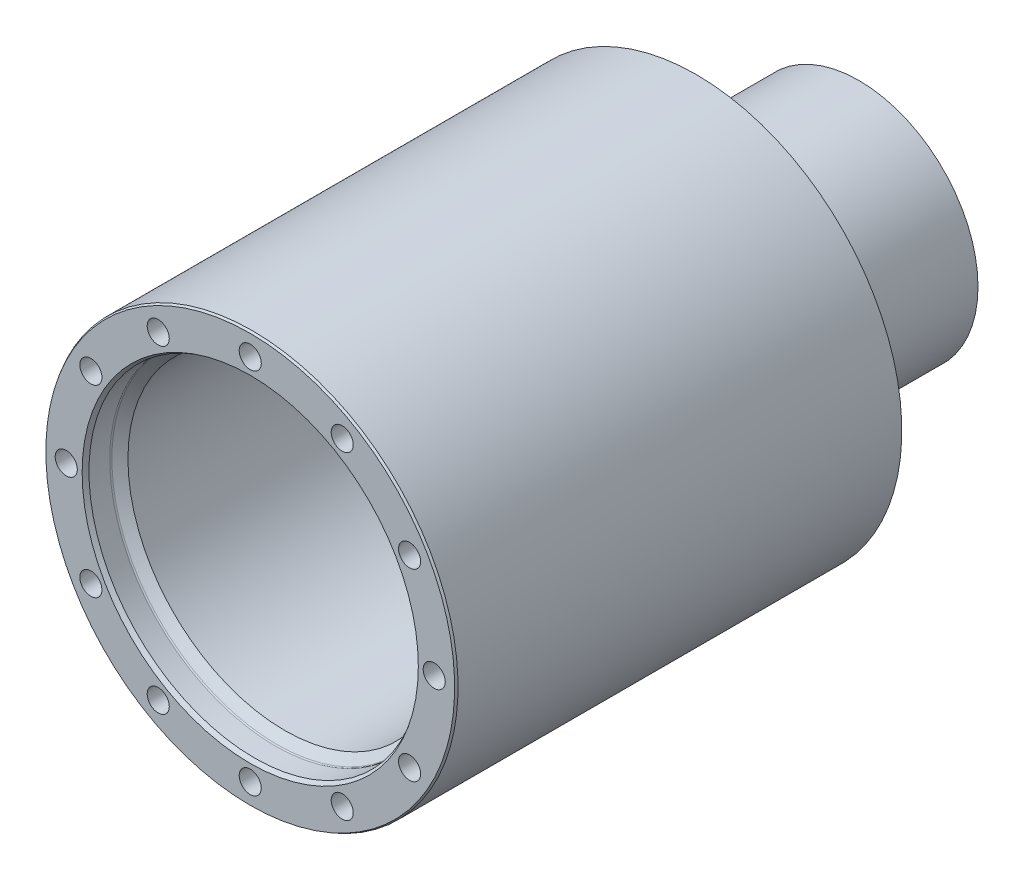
ISO-10303-21;
HEADER;
FILE_DESCRIPTION(('STEP AP214'),'2;1');
FILE_NAME('part.step','',(''),(''),'','','');
FILE_SCHEMA(('AUTOMOTIVE_DESIGN { 1 0 10303 214 1 1 1 1 }'));
ENDSEC;
DATA;
#1=APPLICATION_CONTEXT('core data for automotive mechanical design processes');
#2=APPLICATION_PROTOCOL_DEFINITION('international standard','automotive_design',2000,#1);
#3=PRODUCT_CONTEXT('',#1,'mechanical');
#4=PRODUCT('Part','Part','',(#3));
#5=PRODUCT_RELATED_PRODUCT_CATEGORY('part','',(#4));
#6=PRODUCT_DEFINITION_FORMATION('','',#4);
#7=PRODUCT_DEFINITION_CONTEXT('part definition',#1,'design');
#8=PRODUCT_DEFINITION('design','',#6,#7);
#9=PRODUCT_DEFINITION_SHAPE('','',#8);
#10=(LENGTH_UNIT() NAMED_UNIT(*) SI_UNIT(.MILLI.,.METRE.));
#11=(NAMED_UNIT(*) PLANE_ANGLE_UNIT() SI_UNIT($,.RADIAN.));
#12=(NAMED_UNIT(*) SI_UNIT($,.STERADIAN.) SOLID_ANGLE_UNIT());
#13=UNCERTAINTY_MEASURE_WITH_UNIT(LENGTH_MEASURE(1.E-05),#10,'distance_accuracy_value','');
#14=(GEOMETRIC_REPRESENTATION_CONTEXT(3) GLOBAL_UNCERTAINTY_ASSIGNED_CONTEXT((#13)) GLOBAL_UNIT_ASSIGNED_CONTEXT((#10,
#11,#12)) REPRESENTATION_CONTEXT('',''));
#15=CARTESIAN_POINT('',(0.,0.,0.));
#16=DIRECTION('',(0.,0.,1.));
#17=DIRECTION('',(1.,0.,0.));
#18=AXIS2_PLACEMENT_3D('',#15,#16,#17);
#19=CARTESIAN_POINT('',(0.,7.15584993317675E-07,41.));
#20=DIRECTION('',(0.,-1.74532925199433E-08,-1.));
#21=DIRECTION('',(0.,-1.,1.74532925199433E-08));
#22=AXIS2_PLACEMENT_3D('',#19,#20,#21);
#23=PLANE('',#22);
#24=CARTESIAN_POINT('',(7.354117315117E-13,7.15585575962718E-07,41.));
#25=DIRECTION('',(0.,1.74532925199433E-08,1.));
#26=DIRECTION('',(0.,-1.,1.74532925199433E-08));
#27=AXIS2_PLACEMENT_3D('',#24,#25,#26);
#28=CIRCLE('',#27,94.4226445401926);
#29=CARTESIAN_POINT('',(0.,-94.422643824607,41.0000016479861));
#30=VERTEX_POINT('',#29);
#31=EDGE_CURVE('E11',#30,#30,#28,.T.);
#32=ORIENTED_EDGE('',*,*,#31,.T.);
#33=EDGE_LOOP('',(#32));
#34=FACE_BOUND('',#33,.T.);
#35=CARTESIAN_POINT('',(0.,85.000000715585,40.9999985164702));
#36=DIRECTION('',(0.,1.74532925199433E-08,1.));
#37=DIRECTION('',(0.,1.,-1.74532925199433E-08));
#38=AXIS2_PLACEMENT_3D('',#35,#36,#37);
#39=CIRCLE('',#38,5.1);
#40=CARTESIAN_POINT('',(0.,90.100000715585,40.9999984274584));
#41=VERTEX_POINT('',#40);
#42=EDGE_CURVE('E248',#41,#41,#39,.T.);
#43=ORIENTED_EDGE('',*,*,#42,.F.);
#44=EDGE_LOOP('',(#43));
#45=FACE_BOUND('',#44,.T.);
#46=CARTESIAN_POINT('',(42.5,73.612160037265,40.9999987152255));
#47=DIRECTION('',(0.,1.74532925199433E-08,1.));
#48=DIRECTION('',(0.500000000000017,0.866025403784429,-1.51149947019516E-08));
#49=AXIS2_PLACEMENT_3D('',#46,#47,#48);
#50=CIRCLE('',#49,5.1);
#51=CARTESIAN_POINT('',(45.05,78.028889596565,40.999998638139));
#52=VERTEX_POINT('',#51);
#53=EDGE_CURVE('E249',#52,#52,#50,.T.);
#54=ORIENTED_EDGE('',*,*,#53,.F.);
#55=EDGE_LOOP('',(#54));
#56=FACE_BOUND('',#55,.T.);
#57=CARTESIAN_POINT('',(73.61215932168,42.500000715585,40.9999992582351));
#58=DIRECTION('',(0.,1.74532925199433E-08,1.));
#59=DIRECTION('',(0.866025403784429,0.500000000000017,-8.72664625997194E-09));
#60=AXIS2_PLACEMENT_3D('',#57,#58,#59);
#61=CIRCLE('',#60,5.1);
#62=CARTESIAN_POINT('',(78.02888888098,45.050000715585,40.9999992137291));
#63=VERTEX_POINT('',#62);
#64=EDGE_CURVE('E259',#63,#63,#61,.T.);
#65=ORIENTED_EDGE('',*,*,#64,.F.);
#66=EDGE_LOOP('',(#65));
#67=FACE_BOUND('',#66,.T.);
#68=CARTESIAN_POINT('',(85.,7.15584993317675E-07,41.));
#69=DIRECTION('',(0.,1.74532925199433E-08,1.));
#70=DIRECTION('',(1.,0.,0.));
#71=AXIS2_PLACEMENT_3D('',#68,#69,#70);
#72=CIRCLE('',#71,5.1);
#73=CARTESIAN_POINT('',(90.1,7.15584993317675E-07,41.));
#74=VERTEX_POINT('',#73);
#75=EDGE_CURVE('E230',#74,#74,#72,.T.);
#76=ORIENTED_EDGE('',*,*,#75,.F.);
#77=EDGE_LOOP('',(#76));
#78=FACE_BOUND('',#77,.T.);
#79=CARTESIAN_POINT('',(73.61215932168,-42.499999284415,41.0000007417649));
#80=DIRECTION('',(0.,1.74532925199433E-08,1.));
#81=DIRECTION('',(0.866025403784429,-0.500000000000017,8.72664625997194E-09));
#82=AXIS2_PLACEMENT_3D('',#79,#80,#81);
#83=CIRCLE('',#82,5.1);
#84=CARTESIAN_POINT('',(78.02888888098,-45.049999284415,41.0000007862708));
#85=VERTEX_POINT('',#84);
#86=EDGE_CURVE('E231',#85,#85,#83,.T.);
#87=ORIENTED_EDGE('',*,*,#86,.F.);
#88=EDGE_LOOP('',(#87));
#89=FACE_BOUND('',#88,.T.);
#90=CARTESIAN_POINT('',(42.5,-73.612158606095,41.0000012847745));
#91=DIRECTION('',(0.,1.74532925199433E-08,1.));
#92=DIRECTION('',(0.500000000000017,-0.866025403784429,1.51149947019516E-08));
#93=AXIS2_PLACEMENT_3D('',#90,#91,#92);
#94=CIRCLE('',#93,5.1);
#95=CARTESIAN_POINT('',(45.05,-78.028888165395,41.000001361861));
#96=VERTEX_POINT('',#95);
#97=EDGE_CURVE('E236',#96,#96,#94,.T.);
#98=ORIENTED_EDGE('',*,*,#97,.F.);
#99=EDGE_LOOP('',(#98));
#100=FACE_BOUND('',#99,.T.);
#101=CARTESIAN_POINT('',(0.,-84.999999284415,41.0000014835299));
#102=DIRECTION('',(0.,1.74532925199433E-08,1.));
#103=DIRECTION('',(0.,-1.,1.74532925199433E-08));
#104=AXIS2_PLACEMENT_3D('',#101,#102,#103);
#105=CIRCLE('',#104,5.1);
#106=CARTESIAN_POINT('',(0.,-90.099999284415,41.0000015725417));
#107=VERTEX_POINT('',#106);
#108=EDGE_CURVE('E281',#107,#107,#105,.T.);
#109=ORIENTED_EDGE('',*,*,#108,.F.);
#110=EDGE_LOOP('',(#109));
#111=FACE_BOUND('',#110,.T.);
#112=CARTESIAN_POINT('',(-42.5,-73.612158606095,41.0000012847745));
#113=DIRECTION('',(0.,1.74532925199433E-08,1.));
#114=DIRECTION('',(-0.500000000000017,-0.866025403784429,1.51149947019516E-08));
#115=AXIS2_PLACEMENT_3D('',#112,#113,#114);
#116=CIRCLE('',#115,5.1);
#117=CARTESIAN_POINT('',(-45.05,-78.028888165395,41.000001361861));
#118=VERTEX_POINT('',#117);
#119=EDGE_CURVE('E282',#118,#118,#116,.T.);
#120=ORIENTED_EDGE('',*,*,#119,.F.);
#121=EDGE_LOOP('',(#120));
#122=FACE_BOUND('',#121,.T.);
#123=CARTESIAN_POINT('',(-73.61215932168,-42.499999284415,41.0000007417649));
#124=DIRECTION('',(0.,1.74532925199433E-08,1.));
#125=DIRECTION('',(-0.866025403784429,-0.500000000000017,8.72664625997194E-09));
#126=AXIS2_PLACEMENT_3D('',#123,#124,#125);
#127=CIRCLE('',#126,5.1);
#128=CARTESIAN_POINT('',(-78.02888888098,-45.049999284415,41.0000007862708));
#129=VERTEX_POINT('',#128);
#130=EDGE_CURVE('E272',#129,#129,#127,.T.);
#131=ORIENTED_EDGE('',*,*,#130,.F.);
#132=EDGE_LOOP('',(#131));
#133=FACE_BOUND('',#132,.T.);
#134=CARTESIAN_POINT('',(-85.,7.1558497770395E-07,41.));
#135=DIRECTION('',(0.,1.74532925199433E-08,1.));
#136=DIRECTION('',(-1.,0.,0.));
#137=AXIS2_PLACEMENT_3D('',#134,#135,#136);
#138=CIRCLE('',#137,5.1);
#139=CARTESIAN_POINT('',(-90.1,7.15584976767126E-07,41.));
#140=VERTEX_POINT('',#139);
#141=EDGE_CURVE('E205',#140,#140,#138,.T.);
#142=ORIENTED_EDGE('',*,*,#141,.F.);
#143=EDGE_LOOP('',(#142));
#144=FACE_BOUND('',#143,.T.);
#145=CARTESIAN_POINT('',(-73.61215932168,42.500000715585,40.9999992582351));
#146=DIRECTION('',(0.,1.74532925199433E-08,1.));
#147=DIRECTION('',(-0.866025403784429,0.500000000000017,-8.72664625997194E-09));
#148=AXIS2_PLACEMENT_3D('',#145,#146,#147);
#149=CIRCLE('',#148,5.1);
#150=CARTESIAN_POINT('',(-78.02888888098,45.050000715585,40.9999992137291));
#151=VERTEX_POINT('',#150);
#152=EDGE_CURVE('E206',#151,#151,#149,.T.);
#153=ORIENTED_EDGE('',*,*,#152,.F.);
#154=EDGE_LOOP('',(#153));
#155=FACE_BOUND('',#154,.T.);
#156=CARTESIAN_POINT('',(-42.5,73.612160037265,40.9999987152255));
#157=DIRECTION('',(0.,1.74532925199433E-08,1.));
#158=DIRECTION('',(-0.500000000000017,0.866025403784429,-1.51149947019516E-08));
#159=AXIS2_PLACEMENT_3D('',#156,#157,#158);
#160=CIRCLE('',#159,5.1);
#161=CARTESIAN_POINT('',(-45.05,78.028889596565,40.999998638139));
#162=VERTEX_POINT('',#161);
#163=EDGE_CURVE('E252',#162,#162,#160,.T.);
#164=ORIENTED_EDGE('',*,*,#163,.F.);
#165=EDGE_LOOP('',(#164));
#166=FACE_BOUND('',#165,.T.);
#167=CARTESIAN_POINT('',(4.494182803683E-13,7.15584431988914E-07,41.));
#168=DIRECTION('',(0.,-1.74532925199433E-08,-1.));
#169=DIRECTION('',(0.,-1.,1.74532925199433E-08));
#170=AXIS2_PLACEMENT_3D('',#167,#168,#169);
#171=CIRCLE('',#170,77.6547070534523);
#172=CARTESIAN_POINT('',(0.,77.6547077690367,40.9999986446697));
#173=VERTEX_POINT('',#172);
#174=EDGE_CURVE('E26',#173,#173,#171,.T.);
#175=ORIENTED_EDGE('',*,*,#174,.T.);
#176=EDGE_LOOP('',(#175));
#177=FACE_BOUND('',#176,.T.);
#178=ADVANCED_FACE('F16',(#34,#45,#56,#67,#78,#89,#100,#111,#122,#133,#144,#155,#166,#177),#23,.F.);
#179=CARTESIAN_POINT('',(0.,85.0000001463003,8.38238990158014));
#180=DIRECTION('',(0.,1.74532925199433E-08,1.));
#181=DIRECTION('',(0.,1.,-1.74532925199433E-08));
#182=AXIS2_PLACEMENT_3D('',#179,#180,#181);
#183=CYLINDRICAL_SURFACE('',#182,5.1);
#184=ORIENTED_EDGE('',*,*,#42,.T.);
#185=EDGE_LOOP('',(#184));
#186=FACE_BOUND('',#185,.T.);
#187=CARTESIAN_POINT('',(0.,85.0000002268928,12.9999985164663));
#188=DIRECTION('',(0.,1.74532925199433E-08,1.));
#189=DIRECTION('',(0.,1.,-1.74532925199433E-08));
#190=AXIS2_PLACEMENT_3D('',#187,#188,#189);
#191=CIRCLE('',#190,5.1);
#192=CARTESIAN_POINT('',(0.,90.1000002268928,12.9999984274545));
#193=VERTEX_POINT('',#192);
#194=EDGE_CURVE('E245',#193,#193,#191,.T.);
#195=ORIENTED_EDGE('',*,*,#194,.F.);
#196=EDGE_LOOP('',(#195));
#197=FACE_BOUND('',#196,.T.);
#198=ADVANCED_FACE('F314',(#186,#197),#183,.F.);
#199=CARTESIAN_POINT('',(0.,85.0000002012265,11.5294292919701));
#200=DIRECTION('',(0.,1.74532925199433E-08,1.));
#201=DIRECTION('',(0.,1.,-1.74532925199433E-08));
#202=AXIS2_PLACEMENT_3D('',#199,#200,#201);
#203=CONICAL_SURFACE('',#202,2.652561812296,1.02974425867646);
#204=CARTESIAN_POINT('',(0.,85.0000001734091,9.93560935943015));
#205=VERTEX_POINT('',#204);
#206=VERTEX_LOOP('',#205);
#207=FACE_BOUND('',#206,.T.);
#208=ORIENTED_EDGE('',*,*,#194,.T.);
#209=EDGE_LOOP('',(#208));
#210=FACE_BOUND('',#209,.T.);
#211=ADVANCED_FACE('F344',(#207,#210),#203,.F.);
#212=CARTESIAN_POINT('',(42.5,73.6121594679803,8.38239010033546));
#213=DIRECTION('',(0.,1.74532925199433E-08,1.));
#214=DIRECTION('',(0.500000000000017,0.866025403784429,-1.51149947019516E-08));
#215=AXIS2_PLACEMENT_3D('',#212,#213,#214);
#216=CYLINDRICAL_SURFACE('',#215,5.1);
#217=ORIENTED_EDGE('',*,*,#53,.T.);
#218=EDGE_LOOP('',(#217));
#219=FACE_BOUND('',#218,.T.);
#220=CARTESIAN_POINT('',(42.5,73.6121595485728,12.9999987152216));
#221=DIRECTION('',(0.,1.74532925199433E-08,1.));
#222=DIRECTION('',(0.500000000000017,0.866025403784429,-1.51149947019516E-08));
#223=AXIS2_PLACEMENT_3D('',#220,#221,#222);
#224=CIRCLE('',#223,5.1);
#225=CARTESIAN_POINT('',(45.05,78.0288891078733,12.9999986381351));
#226=VERTEX_POINT('',#225);
#227=EDGE_CURVE('E262',#226,#226,#224,.T.);
#228=ORIENTED_EDGE('',*,*,#227,.F.);
#229=EDGE_LOOP('',(#228));
#230=FACE_BOUND('',#229,.T.);
#231=ADVANCED_FACE('F347',(#219,#230),#216,.F.);
#232=CARTESIAN_POINT('',(42.5,73.6121595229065,11.5294294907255));
#233=DIRECTION('',(0.,1.74532925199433E-08,1.));
#234=DIRECTION('',(0.500000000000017,0.866025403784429,-1.51149947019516E-08));
#235=AXIS2_PLACEMENT_3D('',#232,#233,#234);
#236=CONICAL_SURFACE('',#235,2.652561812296,1.02974425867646);
#237=CARTESIAN_POINT('',(42.5,73.6121594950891,9.93560955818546));
#238=VERTEX_POINT('',#237);
#239=VERTEX_LOOP('',#238);
#240=FACE_BOUND('',#239,.T.);
#241=ORIENTED_EDGE('',*,*,#227,.T.);
#242=EDGE_LOOP('',(#241));
#243=FACE_BOUND('',#242,.T.);
#244=ADVANCED_FACE('F395',(#240,#243),#236,.F.);
#245=CARTESIAN_POINT('',(73.61215932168,42.5000001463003,8.38239064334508));
#246=DIRECTION('',(0.,1.74532925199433E-08,1.));
#247=DIRECTION('',(0.866025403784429,0.500000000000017,-8.72664625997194E-09));
#248=AXIS2_PLACEMENT_3D('',#245,#246,#247);
#249=CYLINDRICAL_SURFACE('',#248,5.1);
#250=ORIENTED_EDGE('',*,*,#64,.T.);
#251=EDGE_LOOP('',(#250));
#252=FACE_BOUND('',#251,.T.);
#253=CARTESIAN_POINT('',(73.61215932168,42.5000002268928,12.9999992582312));
#254=DIRECTION('',(0.,1.74532925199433E-08,1.));
#255=DIRECTION('',(0.866025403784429,0.500000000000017,-8.72664625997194E-09));
#256=AXIS2_PLACEMENT_3D('',#253,#254,#255);
#257=CIRCLE('',#256,5.1);
#258=CARTESIAN_POINT('',(78.0288888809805,45.0500002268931,12.9999992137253));
#259=VERTEX_POINT('',#258);
#260=EDGE_CURVE('E263',#259,#259,#257,.T.);
#261=ORIENTED_EDGE('',*,*,#260,.F.);
#262=EDGE_LOOP('',(#261));
#263=FACE_BOUND('',#262,.T.);
#264=ADVANCED_FACE('F392',(#252,#263),#249,.F.);
#265=CARTESIAN_POINT('',(73.61215932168,42.5000002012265,11.5294300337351));
#266=DIRECTION('',(0.,1.74532925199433E-08,1.));
#267=DIRECTION('',(0.866025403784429,0.500000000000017,-8.72664625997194E-09));
#268=AXIS2_PLACEMENT_3D('',#265,#266,#267);
#269=CONICAL_SURFACE('',#268,2.652561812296,1.02974425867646);
#270=CARTESIAN_POINT('',(73.61215932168,42.5000001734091,9.93561010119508));
#271=VERTEX_POINT('',#270);
#272=VERTEX_LOOP('',#271);
#273=FACE_BOUND('',#272,.T.);
#274=ORIENTED_EDGE('',*,*,#260,.T.);
#275=EDGE_LOOP('',(#274));
#276=FACE_BOUND('',#275,.T.);
#277=ADVANCED_FACE('F359',(#273,#276),#269,.F.);
#278=CARTESIAN_POINT('',(85.,1.46300328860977E-07,8.38239138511));
#279=DIRECTION('',(0.,1.74532925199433E-08,1.));
#280=DIRECTION('',(1.,0.,0.));
#281=AXIS2_PLACEMENT_3D('',#278,#279,#280);
#282=CYLINDRICAL_SURFACE('',#281,5.1);
#283=ORIENTED_EDGE('',*,*,#75,.T.);
#284=EDGE_LOOP('',(#283));
#285=FACE_BOUND('',#284,.T.);
#286=CARTESIAN_POINT('',(85.,2.26892802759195E-07,12.9999999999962));
#287=DIRECTION('',(0.,1.74532925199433E-08,1.));
#288=DIRECTION('',(1.,0.,0.));
#289=AXIS2_PLACEMENT_3D('',#286,#287,#288);
#290=CIRCLE('',#289,5.1);
#291=CARTESIAN_POINT('',(90.1,2.26892802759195E-07,12.9999999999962));
#292=VERTEX_POINT('',#291);
#293=EDGE_CURVE('E227',#292,#292,#290,.T.);
#294=ORIENTED_EDGE('',*,*,#293,.F.);
#295=EDGE_LOOP('',(#294));
#296=FACE_BOUND('',#295,.T.);
#297=ADVANCED_FACE('F355',(#285,#296),#282,.F.);
#298=CARTESIAN_POINT('',(85.,2.01226527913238E-07,11.5294307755));
#299=DIRECTION('',(0.,1.74532925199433E-08,1.));
#300=DIRECTION('',(1.,0.,0.));
#301=AXIS2_PLACEMENT_3D('',#298,#299,#300);
#302=CONICAL_SURFACE('',#301,2.652561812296,1.02974425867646);
#303=CARTESIAN_POINT('',(85.,1.73409122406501E-07,9.93561084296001));
#304=VERTEX_POINT('',#303);
#305=VERTEX_LOOP('',#304);
#306=FACE_BOUND('',#305,.T.);
#307=ORIENTED_EDGE('',*,*,#293,.T.);
#308=EDGE_LOOP('',(#307));
#309=FACE_BOUND('',#308,.T.);
#310=ADVANCED_FACE('F358',(#306,#309),#302,.F.);
#311=CARTESIAN_POINT('',(73.61215932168,-42.4999998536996,8.38239212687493));
#312=DIRECTION('',(0.,1.74532925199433E-08,1.));
#313=DIRECTION('',(0.866025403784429,-0.500000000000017,8.72664625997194E-09));
#314=AXIS2_PLACEMENT_3D('',#311,#312,#313);
#315=CYLINDRICAL_SURFACE('',#314,5.1);
#316=ORIENTED_EDGE('',*,*,#86,.T.);
#317=EDGE_LOOP('',(#316));
#318=FACE_BOUND('',#317,.T.);
#319=CARTESIAN_POINT('',(73.61215932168,-42.4999997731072,13.0000007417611));
#320=DIRECTION('',(0.,1.74532925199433E-08,1.));
#321=DIRECTION('',(0.866025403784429,-0.500000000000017,8.72664625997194E-09));
#322=AXIS2_PLACEMENT_3D('',#319,#320,#321);
#323=CIRCLE('',#322,5.1);
#324=CARTESIAN_POINT('',(78.0288888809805,-45.0499997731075,13.000000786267));
#325=VERTEX_POINT('',#324);
#326=EDGE_CURVE('E239',#325,#325,#323,.T.);
#327=ORIENTED_EDGE('',*,*,#326,.F.);
#328=EDGE_LOOP('',(#327));
#329=FACE_BOUND('',#328,.T.);
#330=ADVANCED_FACE('F387',(#318,#329),#315,.F.);
#331=CARTESIAN_POINT('',(73.61215932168,-42.4999997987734,11.5294315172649));
#332=DIRECTION('',(0.,1.74532925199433E-08,1.));
#333=DIRECTION('',(0.866025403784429,-0.500000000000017,8.72664625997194E-09));
#334=AXIS2_PLACEMENT_3D('',#331,#332,#333);
#335=CONICAL_SURFACE('',#334,2.652561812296,1.02974425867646);
#336=CARTESIAN_POINT('',(73.61215932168,-42.4999998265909,9.93561158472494));
#337=VERTEX_POINT('',#336);
#338=VERTEX_LOOP('',#337);
#339=FACE_BOUND('',#338,.T.);
#340=ORIENTED_EDGE('',*,*,#326,.T.);
#341=EDGE_LOOP('',(#340));
#342=FACE_BOUND('',#341,.T.);
#343=ADVANCED_FACE('F390',(#339,#342),#335,.F.);
#344=CARTESIAN_POINT('',(42.5,-73.6121591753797,8.38239266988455));
#345=DIRECTION('',(0.,1.74532925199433E-08,1.));
#346=DIRECTION('',(0.500000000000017,-0.866025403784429,1.51149947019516E-08));
#347=AXIS2_PLACEMENT_3D('',#344,#345,#346);
#348=CYLINDRICAL_SURFACE('',#347,5.1);
#349=ORIENTED_EDGE('',*,*,#97,.T.);
#350=EDGE_LOOP('',(#349));
#351=FACE_BOUND('',#350,.T.);
#352=CARTESIAN_POINT('',(42.5,-73.6121590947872,13.0000012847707));
#353=DIRECTION('',(0.,-1.74532925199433E-08,-1.));
#354=DIRECTION('',(0.500000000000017,-0.866025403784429,1.51149947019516E-08));
#355=AXIS2_PLACEMENT_3D('',#352,#353,#354);
#356=CIRCLE('',#355,5.1);
#357=CARTESIAN_POINT('',(45.05,-78.0288886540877,13.0000013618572));
#358=VERTEX_POINT('',#357);
#359=EDGE_CURVE('E240',#358,#358,#356,.T.);
#360=ORIENTED_EDGE('',*,*,#359,.T.);
#361=EDGE_LOOP('',(#360));
#362=FACE_BOUND('',#361,.T.);
#363=ADVANCED_FACE('F428',(#351,#362),#348,.F.);
#364=CARTESIAN_POINT('',(42.5,-73.6121591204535,11.5294320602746));
#365=DIRECTION('',(0.,1.74532925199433E-08,1.));
#366=DIRECTION('',(0.500000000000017,-0.866025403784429,1.51149947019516E-08));
#367=AXIS2_PLACEMENT_3D('',#364,#365,#366);
#368=CONICAL_SURFACE('',#367,2.652561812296,1.02974425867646);
#369=CARTESIAN_POINT('',(42.5,-73.6121591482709,9.93561212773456));
#370=VERTEX_POINT('',#369);
#371=VERTEX_LOOP('',#370);
#372=FACE_BOUND('',#371,.T.);
#373=ORIENTED_EDGE('',*,*,#359,.F.);
#374=EDGE_LOOP('',(#373));
#375=FACE_BOUND('',#374,.T.);
#376=ADVANCED_FACE('F401',(#372,#375),#368,.F.);
#377=CARTESIAN_POINT('',(0.,-84.9999998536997,8.38239286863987));
#378=DIRECTION('',(0.,1.74532925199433E-08,1.));
#379=DIRECTION('',(0.,-1.,1.74532925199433E-08));
#380=AXIS2_PLACEMENT_3D('',#377,#378,#379);
#381=CYLINDRICAL_SURFACE('',#380,5.1);
#382=ORIENTED_EDGE('',*,*,#108,.T.);
#383=EDGE_LOOP('',(#382));
#384=FACE_BOUND('',#383,.T.);
#385=CARTESIAN_POINT('',(0.,-84.9999997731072,13.000001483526));
#386=DIRECTION('',(0.,-1.74532925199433E-08,-1.));
#387=DIRECTION('',(0.,-1.,1.74532925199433E-08));
#388=AXIS2_PLACEMENT_3D('',#385,#386,#387);
#389=CIRCLE('',#388,5.1);
#390=CARTESIAN_POINT('',(0.,-90.0999997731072,13.0000015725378));
#391=VERTEX_POINT('',#390);
#392=EDGE_CURVE('E278',#391,#391,#389,.T.);
#393=ORIENTED_EDGE('',*,*,#392,.T.);
#394=EDGE_LOOP('',(#393));
#395=FACE_BOUND('',#394,.T.);
#396=ADVANCED_FACE('F397',(#384,#395),#381,.F.);
#397=CARTESIAN_POINT('',(0.,-84.9999997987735,11.5294322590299));
#398=DIRECTION('',(0.,1.74532925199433E-08,1.));
#399=DIRECTION('',(0.,-1.,1.74532925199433E-08));
#400=AXIS2_PLACEMENT_3D('',#397,#398,#399);
#401=CONICAL_SURFACE('',#400,2.652561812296,1.02974425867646);
#402=CARTESIAN_POINT('',(0.,-84.9999998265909,9.93561232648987));
#403=VERTEX_POINT('',#402);
#404=VERTEX_LOOP('',#403);
#405=FACE_BOUND('',#404,.T.);
#406=ORIENTED_EDGE('',*,*,#392,.F.);
#407=EDGE_LOOP('',(#406));
#408=FACE_BOUND('',#407,.T.);
#409=ADVANCED_FACE('F400',(#405,#408),#401,.F.);
#410=CARTESIAN_POINT('',(-42.5,-73.6121591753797,8.38239266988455));
#411=DIRECTION('',(0.,1.74532925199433E-08,1.));
#412=DIRECTION('',(-0.500000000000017,-0.866025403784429,1.51149947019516E-08));
#413=AXIS2_PLACEMENT_3D('',#410,#411,#412);
#414=CYLINDRICAL_SURFACE('',#413,5.1);
#415=ORIENTED_EDGE('',*,*,#119,.T.);
#416=EDGE_LOOP('',(#415));
#417=FACE_BOUND('',#416,.T.);
#418=CARTESIAN_POINT('',(-42.5,-73.6121590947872,13.0000012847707));
#419=DIRECTION('',(0.,-1.74532925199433E-08,-1.));
#420=DIRECTION('',(-0.500000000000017,-0.866025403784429,1.51149947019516E-08));
#421=AXIS2_PLACEMENT_3D('',#418,#419,#420);
#422=CIRCLE('',#421,5.1);
#423=CARTESIAN_POINT('',(-45.05,-78.0288886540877,13.0000013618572));
#424=VERTEX_POINT('',#423);
#425=EDGE_CURVE('E275',#424,#424,#422,.T.);
#426=ORIENTED_EDGE('',*,*,#425,.T.);
#427=EDGE_LOOP('',(#426));
#428=FACE_BOUND('',#427,.T.);
#429=ADVANCED_FACE('F309',(#417,#428),#414,.F.);
#430=CARTESIAN_POINT('',(-42.5,-73.6121591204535,11.5294320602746));
#431=DIRECTION('',(0.,1.74532925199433E-08,1.));
#432=DIRECTION('',(-0.500000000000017,-0.866025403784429,1.51149947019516E-08));
#433=AXIS2_PLACEMENT_3D('',#430,#431,#432);
#434=CONICAL_SURFACE('',#433,2.652561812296,1.02974425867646);
#435=CARTESIAN_POINT('',(-42.5,-73.6121591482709,9.93561212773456));
#436=VERTEX_POINT('',#435);
#437=VERTEX_LOOP('',#436);
#438=FACE_BOUND('',#437,.T.);
#439=ORIENTED_EDGE('',*,*,#425,.F.);
#440=EDGE_LOOP('',(#439));
#441=FACE_BOUND('',#440,.T.);
#442=ADVANCED_FACE('F365',(#438,#441),#434,.F.);
#443=CARTESIAN_POINT('',(-73.61215932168,-42.4999998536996,8.38239212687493));
#444=DIRECTION('',(0.,1.74532925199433E-08,1.));
#445=DIRECTION('',(-0.866025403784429,-0.500000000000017,8.72664625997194E-09));
#446=AXIS2_PLACEMENT_3D('',#443,#444,#445);
#447=CYLINDRICAL_SURFACE('',#446,5.1);
#448=ORIENTED_EDGE('',*,*,#130,.T.);
#449=EDGE_LOOP('',(#448));
#450=FACE_BOUND('',#449,.T.);
#451=CARTESIAN_POINT('',(-73.61215932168,-42.4999997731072,13.0000007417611));
#452=DIRECTION('',(0.,1.74532925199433E-08,1.));
#453=DIRECTION('',(-0.866025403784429,-0.500000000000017,8.72664625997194E-09));
#454=AXIS2_PLACEMENT_3D('',#451,#452,#453);
#455=CIRCLE('',#454,5.1);
#456=CARTESIAN_POINT('',(-78.0288888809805,-45.0499997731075,13.000000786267));
#457=VERTEX_POINT('',#456);
#458=EDGE_CURVE('E209',#457,#457,#455,.T.);
#459=ORIENTED_EDGE('',*,*,#458,.F.);
#460=EDGE_LOOP('',(#459));
#461=FACE_BOUND('',#460,.T.);
#462=ADVANCED_FACE('F361',(#450,#461),#447,.F.);
#463=CARTESIAN_POINT('',(-73.61215932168,-42.4999997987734,11.5294315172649));
#464=DIRECTION('',(0.,1.74532925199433E-08,1.));
#465=DIRECTION('',(-0.866025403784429,-0.500000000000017,8.72664625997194E-09));
#466=AXIS2_PLACEMENT_3D('',#463,#464,#465);
#467=CONICAL_SURFACE('',#466,2.652561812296,1.02974425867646);
#468=CARTESIAN_POINT('',(-73.61215932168,-42.4999998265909,9.93561158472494));
#469=VERTEX_POINT('',#468);
#470=VERTEX_LOOP('',#469);
#471=FACE_BOUND('',#470,.T.);
#472=ORIENTED_EDGE('',*,*,#458,.T.);
#473=EDGE_LOOP('',(#472));
#474=FACE_BOUND('',#473,.T.);
#475=ADVANCED_FACE('F364',(#471,#474),#467,.F.);
#476=CARTESIAN_POINT('',(-85.,1.46300313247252E-07,8.38239138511));
#477=DIRECTION('',(0.,1.74532925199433E-08,1.));
#478=DIRECTION('',(-1.,0.,0.));
#479=AXIS2_PLACEMENT_3D('',#476,#477,#478);
#480=CYLINDRICAL_SURFACE('',#479,5.1);
#481=ORIENTED_EDGE('',*,*,#141,.T.);
#482=EDGE_LOOP('',(#481));
#483=FACE_BOUND('',#482,.T.);
#484=CARTESIAN_POINT('',(-85.,2.26892787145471E-07,12.9999999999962));
#485=DIRECTION('',(0.,1.74532925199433E-08,1.));
#486=DIRECTION('',(-1.,0.,0.));
#487=AXIS2_PLACEMENT_3D('',#484,#485,#486);
#488=CIRCLE('',#487,5.1);
#489=CARTESIAN_POINT('',(-90.1,2.26892786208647E-07,12.9999999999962));
#490=VERTEX_POINT('',#489);
#491=EDGE_CURVE('E202',#490,#490,#488,.T.);
#492=ORIENTED_EDGE('',*,*,#491,.F.);
#493=EDGE_LOOP('',(#492));
#494=FACE_BOUND('',#493,.T.);
#495=ADVANCED_FACE('F203',(#483,#494),#480,.F.);
#496=CARTESIAN_POINT('',(-85.,2.01226512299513E-07,11.5294307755));
#497=DIRECTION('',(0.,1.74532925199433E-08,1.));
#498=DIRECTION('',(-1.,0.,0.));
#499=AXIS2_PLACEMENT_3D('',#496,#497,#498);
#500=CONICAL_SURFACE('',#499,2.652561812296,1.02974425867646);
#501=CARTESIAN_POINT('',(-85.,1.73409106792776E-07,9.93561084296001));
#502=VERTEX_POINT('',#501);
#503=VERTEX_LOOP('',#502);
#504=FACE_BOUND('',#503,.T.);
#505=ORIENTED_EDGE('',*,*,#491,.T.);
#506=EDGE_LOOP('',(#505));
#507=FACE_BOUND('',#506,.T.);
#508=ADVANCED_FACE('F373',(#504,#507),#500,.F.);
#509=CARTESIAN_POINT('',(-73.61215932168,42.5000001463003,8.38239064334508));
#510=DIRECTION('',(0.,1.74532925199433E-08,1.));
#511=DIRECTION('',(-0.866025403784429,0.500000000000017,-8.72664625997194E-09));
#512=AXIS2_PLACEMENT_3D('',#509,#510,#511);
#513=CYLINDRICAL_SURFACE('',#512,5.1);
#514=ORIENTED_EDGE('',*,*,#152,.T.);
#515=EDGE_LOOP('',(#514));
#516=FACE_BOUND('',#515,.T.);
#517=CARTESIAN_POINT('',(-73.61215932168,42.5000002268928,12.9999992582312));
#518=DIRECTION('',(0.,-1.74532925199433E-08,-1.));
#519=DIRECTION('',(-0.866025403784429,0.500000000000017,-8.72664625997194E-09));
#520=AXIS2_PLACEMENT_3D('',#517,#518,#519);
#521=CIRCLE('',#520,5.1);
#522=CARTESIAN_POINT('',(-78.0288888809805,45.0500002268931,12.9999992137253));
#523=VERTEX_POINT('',#522);
#524=EDGE_CURVE('E212',#523,#523,#521,.T.);
#525=ORIENTED_EDGE('',*,*,#524,.T.);
#526=EDGE_LOOP('',(#525));
#527=FACE_BOUND('',#526,.T.);
#528=ADVANCED_FACE('F376',(#516,#527),#513,.F.);
#529=CARTESIAN_POINT('',(-73.61215932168,42.5000002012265,11.5294300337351));
#530=DIRECTION('',(0.,1.74532925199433E-08,1.));
#531=DIRECTION('',(-0.866025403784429,0.500000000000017,-8.72664625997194E-09));
#532=AXIS2_PLACEMENT_3D('',#529,#530,#531);
#533=CONICAL_SURFACE('',#532,2.652561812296,1.02974425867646);
#534=CARTESIAN_POINT('',(-73.61215932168,42.5000001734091,9.93561010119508));
#535=VERTEX_POINT('',#534);
#536=VERTEX_LOOP('',#535);
#537=FACE_BOUND('',#536,.T.);
#538=ORIENTED_EDGE('',*,*,#524,.F.);
#539=EDGE_LOOP('',(#538));
#540=FACE_BOUND('',#539,.T.);
#541=ADVANCED_FACE('F412',(#537,#540),#533,.F.);
#542=CARTESIAN_POINT('',(-42.5,73.6121594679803,8.38239010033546));
#543=DIRECTION('',(0.,1.74532925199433E-08,1.));
#544=DIRECTION('',(-0.500000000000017,0.866025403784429,-1.51149947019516E-08));
#545=AXIS2_PLACEMENT_3D('',#542,#543,#544);
#546=CYLINDRICAL_SURFACE('',#545,5.1);
#547=ORIENTED_EDGE('',*,*,#163,.T.);
#548=EDGE_LOOP('',(#547));
#549=FACE_BOUND('',#548,.T.);
#550=CARTESIAN_POINT('',(-42.5,73.6121595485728,12.9999987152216));
#551=DIRECTION('',(0.,1.74532925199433E-08,1.));
#552=DIRECTION('',(-0.500000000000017,0.866025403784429,-1.51149947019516E-08));
#553=AXIS2_PLACEMENT_3D('',#550,#551,#552);
#554=CIRCLE('',#553,5.1);
#555=CARTESIAN_POINT('',(-45.05,78.0288891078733,12.9999986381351));
#556=VERTEX_POINT('',#555);
#557=EDGE_CURVE('E501',#556,#556,#554,.T.);
#558=ORIENTED_EDGE('',*,*,#557,.F.);
#559=EDGE_LOOP('',(#558));
#560=FACE_BOUND('',#559,.T.);
#561=ADVANCED_FACE('F409',(#549,#560),#546,.F.);
#562=CARTESIAN_POINT('',(-42.5,73.6121595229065,11.5294294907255));
#563=DIRECTION('',(0.,1.74532925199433E-08,1.));
#564=DIRECTION('',(-0.500000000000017,0.866025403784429,-1.51149947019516E-08));
#565=AXIS2_PLACEMENT_3D('',#562,#563,#564);
#566=CONICAL_SURFACE('',#565,2.652561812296,1.02974425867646);
#567=CARTESIAN_POINT('',(-42.5,73.6121594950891,9.93560955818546));
#568=VERTEX_POINT('',#567);
#569=VERTEX_LOOP('',#568);
#570=FACE_BOUND('',#569,.T.);
#571=ORIENTED_EDGE('',*,*,#557,.T.);
#572=EDGE_LOOP('',(#571));
#573=FACE_BOUND('',#572,.T.);
#574=ADVANCED_FACE('F383',(#570,#573),#566,.F.);
#575=CARTESIAN_POINT('',(7.354117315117E-13,7.06858543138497E-07,40.4999778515));
#576=DIRECTION('',(0.,-1.74532925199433E-08,-1.));
#577=DIRECTION('',(0.,-1.,1.74532925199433E-08));
#578=AXIS2_PLACEMENT_3D('',#575,#576,#577);
#579=CONICAL_SURFACE('',#578,94.71133244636,0.523598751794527);
#580=ORIENTED_EDGE('',*,*,#31,.F.);
#581=EDGE_LOOP('',(#580));
#582=FACE_BOUND('',#581,.T.);
#583=CARTESIAN_POINT('',(0.,6.98131542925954E-07,39.9999909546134));
#584=DIRECTION('',(0.,1.74532925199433E-08,1.));
#585=DIRECTION('',(0.,-1.,1.74532925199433E-08));
#586=AXIS2_PLACEMENT_3D('',#583,#584,#585);
#587=CIRCLE('',#586,95.);
#588=CARTESIAN_POINT('',(0.,95.0000006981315,39.9999892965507));
#589=VERTEX_POINT('',#588);
#590=EDGE_CURVE('E221',#589,#589,#587,.T.);
#591=ORIENTED_EDGE('',*,*,#590,.T.);
#592=EDGE_LOOP('',(#591));
#593=FACE_BOUND('',#592,.T.);
#594=ADVANCED_FACE('F353',(#582,#593),#579,.T.);
#595=CARTESIAN_POINT('',(0.,9.60978286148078E-07,55.06));
#596=DIRECTION('',(0.,-1.74532925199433E-08,-1.));
#597=DIRECTION('',(0.,-1.,1.74532925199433E-08));
#598=AXIS2_PLACEMENT_3D('',#595,#596,#597);
#599=CYLINDRICAL_SURFACE('',#598,95.);
#600=ORIENTED_EDGE('',*,*,#590,.F.);
#601=EDGE_LOOP('',(#600));
#602=FACE_BOUND('',#601,.T.);
#603=CARTESIAN_POINT('',(0.,-2.87979326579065E-06,-165.));
#604=DIRECTION('',(0.,-1.74532925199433E-08,-1.));
#605=DIRECTION('',(0.,-1.,1.74532925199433E-08));
#606=AXIS2_PLACEMENT_3D('',#603,#604,#605);
#607=CIRCLE('',#606,95.);
#608=CARTESIAN_POINT('',(0.,-95.0000028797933,-164.999998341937));
#609=VERTEX_POINT('',#608);
#610=EDGE_CURVE('E218',#609,#609,#607,.T.);
#611=ORIENTED_EDGE('',*,*,#610,.F.);
#612=EDGE_LOOP('',(#611));
#613=FACE_BOUND('',#612,.T.);
#614=ADVANCED_FACE('F349',(#602,#613),#599,.T.);
#615=CARTESIAN_POINT('',(0.,-2.87979326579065E-06,-165.));
#616=DIRECTION('',(0.,-1.74532925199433E-08,-1.));
#617=DIRECTION('',(0.,-1.,1.74532925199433E-08));
#618=AXIS2_PLACEMENT_3D('',#615,#616,#617);
#619=PLANE('',#618);
#620=ORIENTED_EDGE('',*,*,#610,.T.);
#621=EDGE_LOOP('',(#620));
#622=FACE_BOUND('',#621,.T.);
#623=CARTESIAN_POINT('',(0.,-2.87979326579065E-06,-165.));
#624=DIRECTION('',(0.,-1.74532925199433E-08,-1.));
#625=DIRECTION('',(0.,-1.,1.74532925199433E-08));
#626=AXIS2_PLACEMENT_3D('',#623,#624,#625);
#627=CIRCLE('',#626,55.);
#628=CARTESIAN_POINT('',(0.,-55.0000028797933,-164.999999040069));
#629=VERTEX_POINT('',#628);
#630=EDGE_CURVE('E222',#629,#629,#627,.T.);
#631=ORIENTED_EDGE('',*,*,#630,.F.);
#632=EDGE_LOOP('',(#631));
#633=FACE_BOUND('',#632,.T.);
#634=ADVANCED_FACE('F352',(#622,#633),#619,.T.);
#635=CARTESIAN_POINT('',(0.,9.60978286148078E-07,55.06));
#636=DIRECTION('',(0.,-1.74532925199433E-08,-1.));
#637=DIRECTION('',(0.,-1.,1.74532925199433E-08));
#638=AXIS2_PLACEMENT_3D('',#635,#636,#637);
#639=CYLINDRICAL_SURFACE('',#638,55.);
#640=CARTESIAN_POINT('',(0.,-4.19228086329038E-06,-240.2));
#641=DIRECTION('',(0.,-1.74532925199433E-08,-1.));
#642=DIRECTION('',(0.,-1.,1.74532925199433E-08));
#643=AXIS2_PLACEMENT_3D('',#640,#641,#642);
#644=CIRCLE('',#643,55.);
#645=CARTESIAN_POINT('',(0.,-55.0000041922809,-240.199999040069));
#646=VERTEX_POINT('',#645);
#647=EDGE_CURVE('E241',#646,#646,#644,.T.);
#648=ORIENTED_EDGE('',*,*,#647,.F.);
#649=EDGE_LOOP('',(#648));
#650=FACE_BOUND('',#649,.T.);
#651=ORIENTED_EDGE('',*,*,#630,.T.);
#652=EDGE_LOOP('',(#651));
#653=FACE_BOUND('',#652,.T.);
#654=ADVANCED_FACE('F337',(#650,#653),#639,.T.);
#655=CARTESIAN_POINT('',(0.,-4.19228086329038E-06,-240.2));
#656=DIRECTION('',(0.,-1.74532925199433E-08,-1.));
#657=DIRECTION('',(0.,-1.,1.74532925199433E-08));
#658=AXIS2_PLACEMENT_3D('',#655,#656,#657);
#659=PLANE('',#658);
#660=ORIENTED_EDGE('',*,*,#647,.T.);
#661=EDGE_LOOP('',(#660));
#662=FACE_BOUND('',#661,.T.);
#663=ADVANCED_FACE('F327',(#662),#659,.T.);
#664=CARTESIAN_POINT('',(4.494182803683E-13,6.9813093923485E-07,39.99998852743));
#665=DIRECTION('',(0.,1.74532925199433E-08,1.));
#666=DIRECTION('',(0.,-1.,1.74532925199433E-08));
#667=AXIS2_PLACEMENT_3D('',#664,#665,#666);
#668=CONICAL_SURFACE('',#667,77.07735019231,0.523598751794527);
#669=ORIENTED_EDGE('',*,*,#174,.F.);
#670=EDGE_LOOP('',(#669));
#671=FACE_BOUND('',#670,.T.);
#672=CARTESIAN_POINT('',(0.,6.80678209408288E-07,38.9999886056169));
#673=DIRECTION('',(0.,-1.74532925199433E-08,-1.));
#674=DIRECTION('',(0.,-1.,1.74532925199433E-08));
#675=AXIS2_PLACEMENT_3D('',#672,#673,#674);
#676=CIRCLE('',#675,76.5);
#677=CARTESIAN_POINT('',(0.,-76.4999993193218,38.9999899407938));
#678=VERTEX_POINT('',#677);
#679=EDGE_CURVE('E244',#678,#678,#676,.T.);
#680=ORIENTED_EDGE('',*,*,#679,.T.);
#681=EDGE_LOOP('',(#680));
#682=FACE_BOUND('',#681,.T.);
#683=ADVANCED_FACE('F324',(#671,#682),#668,.F.);
#684=CARTESIAN_POINT('',(0.,9.3549647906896E-07,53.6));
#685=DIRECTION('',(0.,-1.74532925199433E-08,-1.));
#686=DIRECTION('',(0.,-1.,1.74532925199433E-08));
#687=AXIS2_PLACEMENT_3D('',#684,#685,#686);
#688=CYLINDRICAL_SURFACE('',#687,76.5);
#689=CARTESIAN_POINT('',(0.,5.13374873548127E-07,29.41421356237));
#690=DIRECTION('',(0.,1.74532925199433E-08,1.));
#691=DIRECTION('',(0.,-1.,1.74532925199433E-08));
#692=AXIS2_PLACEMENT_3D('',#689,#690,#691);
#693=CIRCLE('',#692,76.5);
#694=CARTESIAN_POINT('',(0.,-76.4999994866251,29.4142148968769));
#695=VERTEX_POINT('',#694);
#696=EDGE_CURVE('E226',#695,#695,#693,.T.);
#697=ORIENTED_EDGE('',*,*,#696,.F.);
#698=EDGE_LOOP('',(#697));
#699=FACE_BOUND('',#698,.T.);
#700=ORIENTED_EDGE('',*,*,#679,.F.);
#701=EDGE_LOOP('',(#700));
#702=FACE_BOUND('',#701,.T.);
#703=ADVANCED_FACE('F326',(#699,#702),#688,.F.);
#704=CARTESIAN_POINT('',(0.,5.13374873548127E-07,29.41421356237));
#705=DIRECTION('',(0.,-1.74532925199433E-08,-1.));
#706=DIRECTION('',(-0.00385403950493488,-0.999992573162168,1.74531628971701E-08));
#707=AXIS2_PLACEMENT_3D('',#704,#705,#706);
#708=TOROIDAL_SURFACE('',#707,75.5,1.);
#709=ORIENTED_EDGE('',*,*,#696,.T.);
#710=EDGE_LOOP('',(#709));
#711=FACE_BOUND('',#710,.T.);
#712=CARTESIAN_POINT('',(0.,5.01033532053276E-07,28.7071067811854));
#713=DIRECTION('',(0.,1.74532925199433E-08,1.));
#714=DIRECTION('',(0.,1.,-1.74532925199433E-08));
#715=AXIS2_PLACEMENT_3D('',#712,#713,#714);
#716=CIRCLE('',#715,76.2071067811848);
#717=CARTESIAN_POINT('',(0.,76.2071072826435,28.707105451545));
#718=VERTEX_POINT('',#717);
#719=EDGE_CURVE('E223',#718,#718,#716,.T.);
#720=ORIENTED_EDGE('',*,*,#719,.F.);
#721=EDGE_LOOP('',(#720));
#722=FACE_BOUND('',#721,.T.);
#723=ADVANCED_FACE('F334',(#711,#722),#708,.F.);
#724=CARTESIAN_POINT('',(0.,4.68682937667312E-07,26.85355425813));
#725=DIRECTION('',(0.,1.74532925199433E-08,1.));
#726=DIRECTION('',(0.,1.,-1.74532925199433E-08));
#727=AXIS2_PLACEMENT_3D('',#724,#725,#726);
#728=CONICAL_SURFACE('',#727,74.35355425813,0.785398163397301);
#729=ORIENTED_EDGE('',*,*,#719,.T.);
#730=EDGE_LOOP('',(#729));
#731=FACE_BOUND('',#730,.T.);
#732=CARTESIAN_POINT('',(0.,4.36332312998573E-07,24.9999999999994));
#733=DIRECTION('',(0.,-1.74532925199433E-08,-1.));
#734=DIRECTION('',(0.,-1.,1.74532925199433E-08));
#735=AXIS2_PLACEMENT_3D('',#732,#733,#734);
#736=CIRCLE('',#735,72.5);
#737=CARTESIAN_POINT('',(0.,-72.4999995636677,25.0000012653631));
#738=VERTEX_POINT('',#737);
#739=EDGE_CURVE('E216',#738,#738,#736,.T.);
#740=ORIENTED_EDGE('',*,*,#739,.T.);
#741=EDGE_LOOP('',(#740));
#742=FACE_BOUND('',#741,.T.);
#743=ADVANCED_FACE('F342',(#731,#742),#728,.F.);
#744=CARTESIAN_POINT('',(0.,9.3549647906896E-07,53.6));
#745=DIRECTION('',(0.,-1.74532925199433E-08,-1.));
#746=DIRECTION('',(0.,-1.,1.74532925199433E-08));
#747=AXIS2_PLACEMENT_3D('',#744,#745,#746);
#748=CYLINDRICAL_SURFACE('',#747,72.5);
#749=CARTESIAN_POINT('',(0.,-2.09439510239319E-06,-120.));
#750=DIRECTION('',(0.,1.74532925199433E-08,1.));
#751=DIRECTION('',(0.,-1.,1.74532925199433E-08));
#752=AXIS2_PLACEMENT_3D('',#749,#750,#751);
#753=CIRCLE('',#752,72.5);
#754=CARTESIAN_POINT('',(0.,-72.5000020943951,-119.999998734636));
#755=VERTEX_POINT('',#754);
#756=EDGE_CURVE('E20',#755,#755,#753,.T.);
#757=ORIENTED_EDGE('',*,*,#756,.F.);
#758=EDGE_LOOP('',(#757));
#759=FACE_BOUND('',#758,.T.);
#760=ORIENTED_EDGE('',*,*,#739,.F.);
#761=EDGE_LOOP('',(#760));
#762=FACE_BOUND('',#761,.T.);
#763=ADVANCED_FACE('F420',(#759,#762),#748,.F.);
#764=CARTESIAN_POINT('',(0.,-2.09439510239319E-06,-120.));
#765=DIRECTION('',(0.,-1.74532925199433E-08,-1.));
#766=DIRECTION('',(0.00406667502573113,0.99999173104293,-1.74531481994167E-08));
#767=AXIS2_PLACEMENT_3D('',#764,#765,#766);
#768=TOROIDAL_SURFACE('',#767,71.5,1.);
#769=ORIENTED_EDGE('',*,*,#756,.T.);
#770=EDGE_LOOP('',(#769));
#771=FACE_BOUND('',#770,.T.);
#772=CARTESIAN_POINT('',(0.,-2.11184839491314E-06,-121.));
#773=DIRECTION('',(0.,1.74532925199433E-08,1.));
#774=DIRECTION('',(-1.,0.,0.));
#775=AXIS2_PLACEMENT_3D('',#772,#773,#774);
#776=CIRCLE('',#775,71.5);
#777=CARTESIAN_POINT('',(0.,71.4999976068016,-121.00000124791));
#778=VERTEX_POINT('',#777);
#779=EDGE_CURVE('E288',#778,#778,#776,.T.);
#780=ORIENTED_EDGE('',*,*,#779,.F.);
#781=EDGE_LOOP('',(#780));
#782=FACE_BOUND('',#781,.T.);
#783=ADVANCED_FACE('F423',(#771,#782),#768,.F.);
#784=CARTESIAN_POINT('',(0.,-2.11184839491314E-06,-121.));
#785=DIRECTION('',(0.,-1.74532925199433E-08,-1.));
#786=DIRECTION('',(0.,-1.,1.74532925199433E-08));
#787=AXIS2_PLACEMENT_3D('',#784,#785,#786);
#788=PLANE('',#787);
#789=ORIENTED_EDGE('',*,*,#779,.T.);
#790=EDGE_LOOP('',(#789));
#791=FACE_BOUND('',#790,.T.);
#792=CARTESIAN_POINT('',(0.,-2.11184839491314E-06,-121.));
#793=DIRECTION('',(0.,1.74532925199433E-08,1.));
#794=DIRECTION('',(0.,1.,-1.74532925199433E-08));
#795=AXIS2_PLACEMENT_3D('',#792,#793,#794);
#796=CIRCLE('',#795,45.1794919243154);
#797=CARTESIAN_POINT('',(0.,-45.1794940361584,-120.999999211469));
#798=VERTEX_POINT('',#797);
#799=EDGE_CURVE('E183',#798,#798,#796,.T.);
#800=ORIENTED_EDGE('',*,*,#799,.F.);
#801=EDGE_LOOP('',(#800));
#802=FACE_BOUND('',#801,.T.);
#803=ADVANCED_FACE('F386',(#791,#802),#788,.F.);
#804=CARTESIAN_POINT('',(0.,-2.19911485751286E-06,-126.));
#805=DIRECTION('',(0.,1.74532925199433E-08,1.));
#806=DIRECTION('',(0.,1.,-1.74532925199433E-08));
#807=AXIS2_PLACEMENT_3D('',#804,#805,#806);
#808=CONICAL_SURFACE('',#807,43.83974596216,0.2617993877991);
#809=CARTESIAN_POINT('',(0.,-2.28638132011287E-06,-131.000000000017));
#810=DIRECTION('',(0.,1.74532925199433E-08,1.));
#811=DIRECTION('',(0.,-1.,1.74532925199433E-08));
#812=AXIS2_PLACEMENT_3D('',#809,#810,#811);
#813=CIRCLE('',#812,42.5);
#814=CARTESIAN_POINT('',(0.,-42.5000022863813,-130.999999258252));
#815=VERTEX_POINT('',#814);
#816=EDGE_CURVE('E188',#815,#815,#813,.T.);
#817=ORIENTED_EDGE('',*,*,#816,.F.);
#818=EDGE_LOOP('',(#817));
#819=FACE_BOUND('',#818,.T.);
#820=ORIENTED_EDGE('',*,*,#799,.T.);
#821=EDGE_LOOP('',(#820));
#822=FACE_BOUND('',#821,.T.);
#823=ADVANCED_FACE('F371',(#819,#822),#808,.F.);
#824=CARTESIAN_POINT('',(0.,9.3549647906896E-07,53.6));
#825=DIRECTION('',(0.,-1.74532925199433E-08,-1.));
#826=DIRECTION('',(0.,-1.,1.74532925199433E-08));
#827=AXIS2_PLACEMENT_3D('',#824,#825,#826);
#828=CYLINDRICAL_SURFACE('',#827,42.5);
#829=CARTESIAN_POINT('',(0.,-2.62672052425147E-06,-150.5));
#830=DIRECTION('',(0.,1.74532925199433E-08,1.));
#831=DIRECTION('',(0.,-1.,1.74532925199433E-08));
#832=AXIS2_PLACEMENT_3D('',#829,#830,#831);
#833=CIRCLE('',#832,42.5);
#834=CARTESIAN_POINT('',(0.,-42.5000026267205,-150.499999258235));
#835=VERTEX_POINT('',#834);
#836=EDGE_CURVE('E291',#835,#835,#833,.T.);
#837=ORIENTED_EDGE('',*,*,#836,.F.);
#838=EDGE_LOOP('',(#837));
#839=FACE_BOUND('',#838,.T.);
#840=ORIENTED_EDGE('',*,*,#816,.T.);
#841=EDGE_LOOP('',(#840));
#842=FACE_BOUND('',#841,.T.);
#843=ADVANCED_FACE('F367',(#839,#842),#828,.F.);
#844=CARTESIAN_POINT('',(0.,-2.62672052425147E-06,-150.5));
#845=DIRECTION('',(0.,-1.74532925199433E-08,-1.));
#846=DIRECTION('',(-0.00693723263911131,-0.999975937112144,1.74528725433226E-08));
#847=AXIS2_PLACEMENT_3D('',#844,#845,#846);
#848=TOROIDAL_SURFACE('',#847,42.,0.5);
#849=ORIENTED_EDGE('',*,*,#836,.T.);
#850=EDGE_LOOP('',(#849));
#851=FACE_BOUND('',#850,.T.);
#852=CARTESIAN_POINT('',(0.,-2.63544717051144E-06,-151.));
#853=DIRECTION('',(0.,1.74532925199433E-08,1.));
#854=DIRECTION('',(-1.,0.,0.));
#855=AXIS2_PLACEMENT_3D('',#852,#853,#854);
#856=CIRCLE('',#855,42.);
#857=CARTESIAN_POINT('',(0.,41.9999972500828,-151.000000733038));
#858=VERTEX_POINT('',#857);
#859=EDGE_CURVE('E289',#858,#858,#856,.T.);
#860=ORIENTED_EDGE('',*,*,#859,.F.);
#861=EDGE_LOOP('',(#860));
#862=FACE_BOUND('',#861,.T.);
#863=ADVANCED_FACE('F370',(#851,#862),#848,.F.);
#864=CARTESIAN_POINT('',(0.,-2.63544717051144E-06,-151.));
#865=DIRECTION('',(0.,-1.74532925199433E-08,-1.));
#866=DIRECTION('',(0.,-1.,1.74532925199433E-08));
#867=AXIS2_PLACEMENT_3D('',#864,#865,#866);
#868=PLANE('',#867);
#869=ORIENTED_EDGE('',*,*,#859,.T.);
#870=EDGE_LOOP('',(#869));
#871=FACE_BOUND('',#870,.T.);
#872=CARTESIAN_POINT('',(0.,-2.63544717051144E-06,-151.));
#873=DIRECTION('',(0.,-1.74532925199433E-08,-1.));
#874=DIRECTION('',(0.,-1.,1.74532925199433E-08));
#875=AXIS2_PLACEMENT_3D('',#872,#873,#874);
#876=CIRCLE('',#875,32.5);
#877=CARTESIAN_POINT('',(0.,-32.5000026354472,-150.999999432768));
#878=VERTEX_POINT('',#877);
#879=EDGE_CURVE('E292',#878,#878,#876,.T.);
#880=ORIENTED_EDGE('',*,*,#879,.T.);
#881=EDGE_LOOP('',(#880));
#882=FACE_BOUND('',#881,.T.);
#883=ADVANCED_FACE('F380',(#871,#882),#868,.F.);
#884=CARTESIAN_POINT('',(0.,9.3549647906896E-07,53.6));
#885=DIRECTION('',(0.,-1.74532925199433E-08,-1.));
#886=DIRECTION('',(0.,-1.,1.74532925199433E-08));
#887=AXIS2_PLACEMENT_3D('',#884,#885,#886);
#888=CYLINDRICAL_SURFACE('',#887,32.5);
#889=CARTESIAN_POINT('',(0.,-3.58665161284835E-06,-205.5));
#890=DIRECTION('',(0.,1.74532925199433E-08,1.));
#891=DIRECTION('',(0.,-1.,1.74532925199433E-08));
#892=AXIS2_PLACEMENT_3D('',#889,#890,#891);
#893=CIRCLE('',#892,32.5);
#894=CARTESIAN_POINT('',(0.,32.4999964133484,-205.500000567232));
#895=VERTEX_POINT('',#894);
#896=EDGE_CURVE('E504',#895,#895,#893,.T.);
#897=ORIENTED_EDGE('',*,*,#896,.F.);
#898=EDGE_LOOP('',(#897));
#899=FACE_BOUND('',#898,.T.);
#900=ORIENTED_EDGE('',*,*,#879,.F.);
#901=EDGE_LOOP('',(#900));
#902=FACE_BOUND('',#901,.T.);
#903=ADVANCED_FACE('F18',(#899,#902),#888,.F.);
#904=CARTESIAN_POINT('',(0.,-3.58665161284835E-06,-205.5));
#905=DIRECTION('',(0.,-1.74532925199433E-08,-1.));
#906=DIRECTION('',(0.00907171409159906,0.999958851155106,-1.74525743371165E-08));
#907=AXIS2_PLACEMENT_3D('',#904,#905,#906);
#908=TOROIDAL_SURFACE('',#907,32.,0.5);
#909=ORIENTED_EDGE('',*,*,#896,.T.);
#910=EDGE_LOOP('',(#909));
#911=FACE_BOUND('',#910,.T.);
#912=CARTESIAN_POINT('',(0.,-3.59537825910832E-06,-206.));
#913=DIRECTION('',(0.,1.74532925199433E-08,1.));
#914=DIRECTION('',(-1.,0.,0.));
#915=AXIS2_PLACEMENT_3D('',#912,#913,#914);
#916=CIRCLE('',#915,32.);
#917=CARTESIAN_POINT('',(0.,-32.0000033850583,-205.999999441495));
#918=VERTEX_POINT('',#917);
#919=EDGE_CURVE('E235',#918,#918,#916,.T.);
#920=ORIENTED_EDGE('',*,*,#919,.F.);
#921=EDGE_LOOP('',(#920));
#922=FACE_BOUND('',#921,.T.);
#923=ADVANCED_FACE('F438',(#911,#922),#908,.F.);
#924=CARTESIAN_POINT('',(0.,-3.59537825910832E-06,-206.));
#925=DIRECTION('',(0.,-1.74532925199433E-08,-1.));
#926=DIRECTION('',(0.,-1.,1.74532925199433E-08));
#927=AXIS2_PLACEMENT_3D('',#924,#925,#926);
#928=PLANE('',#927);
#929=ORIENTED_EDGE('',*,*,#919,.T.);
#930=EDGE_LOOP('',(#929));
#931=FACE_BOUND('',#930,.T.);
#932=CARTESIAN_POINT('',(0.,-3.59537825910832E-06,-206.));
#933=DIRECTION('',(0.,-1.74532925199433E-08,-1.));
#934=DIRECTION('',(0.,1.,-1.74532925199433E-08));
#935=AXIS2_PLACEMENT_3D('',#932,#933,#934);
#936=CIRCLE('',#935,7.99999999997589);
#937=CARTESIAN_POINT('',(0.,-8.00000359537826,-205.999999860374));
#938=VERTEX_POINT('',#937);
#939=EDGE_CURVE('E232',#938,#938,#936,.T.);
#940=ORIENTED_EDGE('',*,*,#939,.T.);
#941=EDGE_LOOP('',(#940));
#942=FACE_BOUND('',#941,.T.);
#943=ADVANCED_FACE('F441',(#931,#942),#928,.F.);
#944=CARTESIAN_POINT('',(0.,-3.63790468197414E-06,-208.436584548));
#945=DIRECTION('',(0.,1.74532925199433E-08,1.));
#946=DIRECTION('',(0.,1.,-1.74532925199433E-08));
#947=AXIS2_PLACEMENT_3D('',#944,#945,#946);
#948=CONICAL_SURFACE('',#947,4.101464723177,1.0121970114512);
#949=CARTESIAN_POINT('',(0.,-3.68264472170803E-06,-211.));
#950=VERTEX_POINT('',#949);
#951=VERTEX_LOOP('',#950);
#952=FACE_BOUND('',#951,.T.);
#953=ORIENTED_EDGE('',*,*,#939,.F.);
#954=EDGE_LOOP('',(#953));
#955=FACE_BOUND('',#954,.T.);
#956=ADVANCED_FACE('F454',(#952,#955),#948,.F.);
#957=CLOSED_SHELL('',(#178,#198,#211,#231,#244,#264,#277,#297,#310,#330,#343,#363,#376,#396,
#409,#429,#442,#462,#475,#495,#508,#528,#541,#561,#574,#594,#614,#634,#654,#663,#683,#703,#723,
#743,#763,#783,#803,#823,#843,#863,#883,#903,#923,#943,#956));
#958=MANIFOLD_SOLID_BREP('B1',#957);
#959=ADVANCED_BREP_SHAPE_REPRESENTATION('',(#18,#958),#14);
#960=SHAPE_DEFINITION_REPRESENTATION(#9,#959);
ENDSEC;
END-ISO-10303-21;
